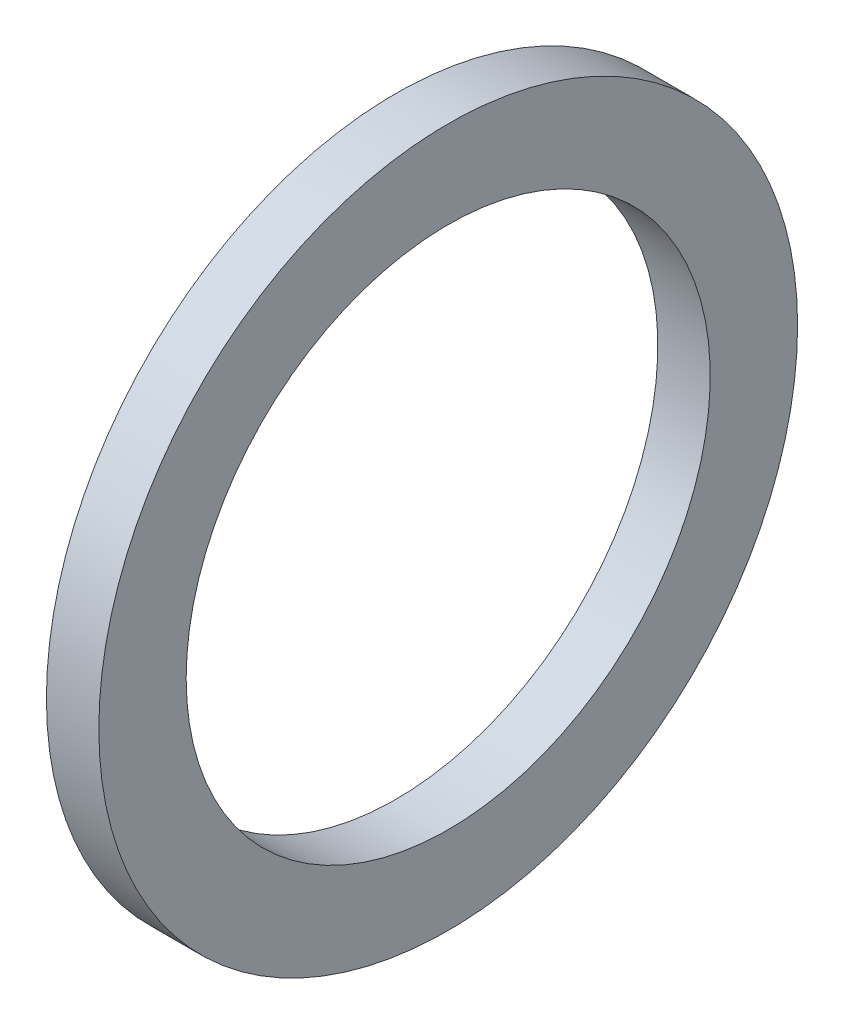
from build123d import *

# Parameters (mm, degrees)
ESQUISSE1_W = 1.5
ESQUISSE1_H = 2.5


with BuildPart() as part:
    # Esquisse1 → R_volution1 (revolve)
    with BuildSketch(Plane.XY, mode=Mode.PRIVATE) as r_volution1_sk:
        with Locations((-3.860971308, 7.201042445)):
            Rectangle(ESQUISSE1_W, ESQUISSE1_H)
    revolve(r_volution1_sk.sketch.rotate(Axis((-9.915823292, -1.548957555, 0), (1, 0, 0)), 90), axis=Axis((-9.915823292, -1.548957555, 0), (1, 0, 0)))


solid = part.part
